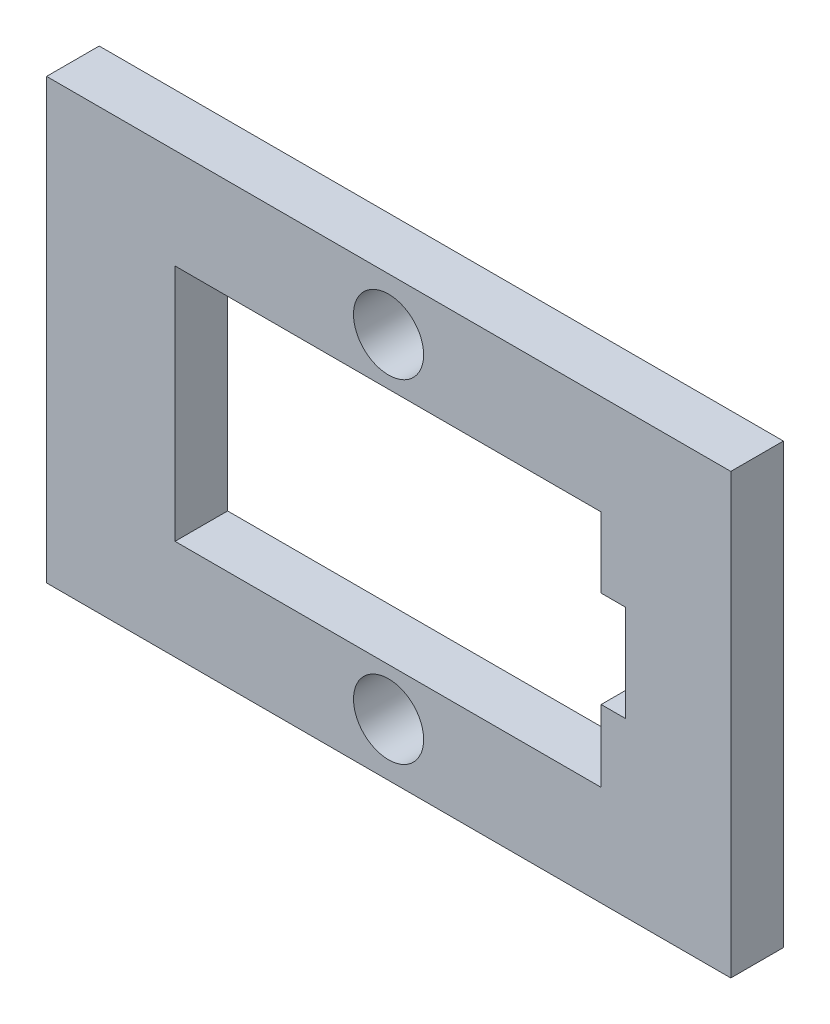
ISO-10303-21;
HEADER;
FILE_DESCRIPTION(('STEP AP214'),'2;1');
FILE_NAME('part.step','',(''),(''),'','','');
FILE_SCHEMA(('AUTOMOTIVE_DESIGN { 1 0 10303 214 1 1 1 1 }'));
ENDSEC;
DATA;
#1=APPLICATION_CONTEXT('core data for automotive mechanical design processes');
#2=APPLICATION_PROTOCOL_DEFINITION('international standard','automotive_design',2000,#1);
#3=PRODUCT_CONTEXT('',#1,'mechanical');
#4=PRODUCT('Part','Part','',(#3));
#5=PRODUCT_RELATED_PRODUCT_CATEGORY('part','',(#4));
#6=PRODUCT_DEFINITION_FORMATION('','',#4);
#7=PRODUCT_DEFINITION_CONTEXT('part definition',#1,'design');
#8=PRODUCT_DEFINITION('design','',#6,#7);
#9=PRODUCT_DEFINITION_SHAPE('','',#8);
#10=(LENGTH_UNIT() NAMED_UNIT(*) SI_UNIT(.MILLI.,.METRE.));
#11=(NAMED_UNIT(*) PLANE_ANGLE_UNIT() SI_UNIT($,.RADIAN.));
#12=(NAMED_UNIT(*) SI_UNIT($,.STERADIAN.) SOLID_ANGLE_UNIT());
#13=UNCERTAINTY_MEASURE_WITH_UNIT(LENGTH_MEASURE(1.E-05),#10,'distance_accuracy_value','');
#14=(GEOMETRIC_REPRESENTATION_CONTEXT(3) GLOBAL_UNCERTAINTY_ASSIGNED_CONTEXT((#13)) GLOBAL_UNIT_ASSIGNED_CONTEXT((#10,
#11,#12)) REPRESENTATION_CONTEXT('',''));
#15=CARTESIAN_POINT('',(0.,0.,0.));
#16=DIRECTION('',(0.,0.,1.));
#17=DIRECTION('',(1.,0.,0.));
#18=AXIS2_PLACEMENT_3D('',#15,#16,#17);
#19=CARTESIAN_POINT('',(4.52665068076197,5.9,0.));
#20=DIRECTION('',(0.,0.,1.));
#21=DIRECTION('',(1.,0.,0.));
#22=AXIS2_PLACEMENT_3D('',#19,#20,#21);
#23=PLANE('',#22);
#24=CARTESIAN_POINT('',(11.526650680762,15.4,0.));
#25=DIRECTION('',(0.,0.,1.));
#26=DIRECTION('',(1.,0.,0.));
#27=AXIS2_PLACEMENT_3D('',#24,#25,#26);
#28=CIRCLE('',#27,2.);
#29=CARTESIAN_POINT('',(13.526650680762,15.4,0.));
#30=VERTEX_POINT('',#29);
#31=EDGE_CURVE('E250',#30,#30,#28,.T.);
#32=ORIENTED_EDGE('',*,*,#31,.T.);
#33=EDGE_LOOP('',(#32));
#34=FACE_BOUND('',#33,.T.);
#35=DIRECTION('',(0.,-1.,0.));
#36=VECTOR('',#35,1.);
#37=CARTESIAN_POINT('',(-7.97334931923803,18.4,0.));
#38=LINE('',#37,#36);
#39=CARTESIAN_POINT('',(-7.97334931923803,18.4,0.));
#40=VERTEX_POINT('',#39);
#41=CARTESIAN_POINT('',(-7.97334931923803,-6.61865156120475,0.));
#42=VERTEX_POINT('',#41);
#43=EDGE_CURVE('E187',#40,#42,#38,.T.);
#44=ORIENTED_EDGE('',*,*,#43,.F.);
#45=DIRECTION('',(1.,0.,0.));
#46=VECTOR('',#45,1.);
#47=CARTESIAN_POINT('',(4.52665068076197,18.4,0.));
#48=LINE('',#47,#46);
#49=CARTESIAN_POINT('',(31.0425160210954,18.4,0.));
#50=VERTEX_POINT('',#49);
#51=EDGE_CURVE('E34',#40,#50,#48,.T.);
#52=ORIENTED_EDGE('',*,*,#51,.T.);
#53=DIRECTION('',(0.,1.,0.));
#54=VECTOR('',#53,1.);
#55=CARTESIAN_POINT('',(31.0425160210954,18.4,0.));
#56=LINE('',#55,#54);
#57=CARTESIAN_POINT('',(31.0425160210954,-6.61865156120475,0.));
#58=VERTEX_POINT('',#57);
#59=EDGE_CURVE('E193',#58,#50,#56,.T.);
#60=ORIENTED_EDGE('',*,*,#59,.F.);
#61=DIRECTION('',(1.,0.,0.));
#62=VECTOR('',#61,1.);
#63=CARTESIAN_POINT('',(-7.97334931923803,-6.61865156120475,0.));
#64=LINE('',#63,#62);
#65=EDGE_CURVE('E189',#42,#58,#64,.T.);
#66=ORIENTED_EDGE('',*,*,#65,.F.);
#67=EDGE_LOOP('',(#44,#52,#60,#66));
#68=FACE_BOUND('',#67,.T.);
#69=DIRECTION('',(0.,-1.,0.));
#70=VECTOR('',#69,1.);
#71=CARTESIAN_POINT('',(-0.650000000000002,12.7,0.));
#72=LINE('',#71,#70);
#73=CARTESIAN_POINT('',(-0.650000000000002,12.7,0.));
#74=VERTEX_POINT('',#73);
#75=CARTESIAN_POINT('',(-0.65,-0.9,0.));
#76=VERTEX_POINT('',#75);
#77=EDGE_CURVE('E45',#74,#76,#72,.T.);
#78=ORIENTED_EDGE('',*,*,#77,.T.);
#79=DIRECTION('',(1.,0.,0.));
#80=VECTOR('',#79,1.);
#81=CARTESIAN_POINT('',(-0.65,-0.9,0.));
#82=LINE('',#81,#80);
#83=CARTESIAN_POINT('',(23.65,-0.9,0.));
#84=VERTEX_POINT('',#83);
#85=EDGE_CURVE('E133',#76,#84,#82,.T.);
#86=ORIENTED_EDGE('',*,*,#85,.T.);
#87=DIRECTION('',(0.,1.,0.));
#88=VECTOR('',#87,1.);
#89=CARTESIAN_POINT('',(23.65,3.19246916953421,0.));
#90=LINE('',#89,#88);
#91=CARTESIAN_POINT('',(23.65,3.19246916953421,0.));
#92=VERTEX_POINT('',#91);
#93=EDGE_CURVE('E159',#84,#92,#90,.T.);
#94=ORIENTED_EDGE('',*,*,#93,.T.);
#95=DIRECTION('',(1.,0.,0.));
#96=VECTOR('',#95,1.);
#97=CARTESIAN_POINT('',(25.0510633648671,3.19246916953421,0.));
#98=LINE('',#97,#96);
#99=CARTESIAN_POINT('',(25.0510633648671,3.19246916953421,0.));
#100=VERTEX_POINT('',#99);
#101=EDGE_CURVE('E162',#92,#100,#98,.T.);
#102=ORIENTED_EDGE('',*,*,#101,.T.);
#103=DIRECTION('',(0.,1.,0.));
#104=VECTOR('',#103,1.);
#105=CARTESIAN_POINT('',(25.0510633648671,8.69069832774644,0.));
#106=LINE('',#105,#104);
#107=CARTESIAN_POINT('',(25.0510633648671,8.69069832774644,0.));
#108=VERTEX_POINT('',#107);
#109=EDGE_CURVE('E165',#100,#108,#106,.T.);
#110=ORIENTED_EDGE('',*,*,#109,.T.);
#111=DIRECTION('',(-1.,0.,0.));
#112=VECTOR('',#111,1.);
#113=CARTESIAN_POINT('',(25.0510633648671,8.69069832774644,0.));
#114=LINE('',#113,#112);
#115=CARTESIAN_POINT('',(23.65,8.69069832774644,0.));
#116=VERTEX_POINT('',#115);
#117=EDGE_CURVE('E168',#108,#116,#114,.T.);
#118=ORIENTED_EDGE('',*,*,#117,.T.);
#119=DIRECTION('',(0.,1.,0.));
#120=VECTOR('',#119,1.);
#121=CARTESIAN_POINT('',(23.65,8.69069832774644,0.));
#122=LINE('',#121,#120);
#123=CARTESIAN_POINT('',(23.65,12.7,0.));
#124=VERTEX_POINT('',#123);
#125=EDGE_CURVE('E171',#116,#124,#122,.T.);
#126=ORIENTED_EDGE('',*,*,#125,.T.);
#127=DIRECTION('',(-1.,0.,0.));
#128=VECTOR('',#127,1.);
#129=CARTESIAN_POINT('',(-0.650000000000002,12.7,0.));
#130=LINE('',#129,#128);
#131=EDGE_CURVE('E127',#124,#74,#130,.T.);
#132=ORIENTED_EDGE('',*,*,#131,.T.);
#133=EDGE_LOOP('',(#78,#86,#94,#102,#110,#118,#126,#132));
#134=FACE_BOUND('',#133,.T.);
#135=CARTESIAN_POINT('',(11.526650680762,-3.6,0.));
#136=DIRECTION('',(0.,0.,1.));
#137=DIRECTION('',(1.,0.,0.));
#138=AXIS2_PLACEMENT_3D('',#135,#136,#137);
#139=CIRCLE('',#138,2.);
#140=CARTESIAN_POINT('',(13.526650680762,-3.6,0.));
#141=VERTEX_POINT('',#140);
#142=EDGE_CURVE('E256',#141,#141,#139,.T.);
#143=ORIENTED_EDGE('',*,*,#142,.T.);
#144=EDGE_LOOP('',(#143));
#145=FACE_BOUND('',#144,.T.);
#146=ADVANCED_FACE('F31',(#34,#68,#134,#145),#23,.F.);
#147=CARTESIAN_POINT('',(4.52665068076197,5.9,3.));
#148=DIRECTION('',(0.,0.,1.));
#149=DIRECTION('',(1.,0.,0.));
#150=AXIS2_PLACEMENT_3D('',#147,#148,#149);
#151=PLANE('',#150);
#152=CARTESIAN_POINT('',(11.526650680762,15.4,3.));
#153=DIRECTION('',(0.,0.,1.));
#154=DIRECTION('',(1.,0.,0.));
#155=AXIS2_PLACEMENT_3D('',#152,#153,#154);
#156=CIRCLE('',#155,2.);
#157=CARTESIAN_POINT('',(13.526650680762,15.4,3.));
#158=VERTEX_POINT('',#157);
#159=EDGE_CURVE('E157',#158,#158,#156,.T.);
#160=ORIENTED_EDGE('',*,*,#159,.F.);
#161=EDGE_LOOP('',(#160));
#162=FACE_BOUND('',#161,.T.);
#163=DIRECTION('',(1.,0.,0.));
#164=VECTOR('',#163,1.);
#165=CARTESIAN_POINT('',(4.52665068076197,18.4,3.));
#166=LINE('',#165,#164);
#167=CARTESIAN_POINT('',(31.0425160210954,18.4,3.));
#168=VERTEX_POINT('',#167);
#169=CARTESIAN_POINT('',(-7.97334931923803,18.4,3.));
#170=VERTEX_POINT('',#169);
#171=EDGE_CURVE('E11',#168,#170,#166,.F.);
#172=ORIENTED_EDGE('',*,*,#171,.T.);
#173=DIRECTION('',(0.,-1.,0.));
#174=VECTOR('',#173,1.);
#175=CARTESIAN_POINT('',(-7.97334931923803,18.4,3.));
#176=LINE('',#175,#174);
#177=CARTESIAN_POINT('',(-7.97334931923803,-6.61865156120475,3.));
#178=VERTEX_POINT('',#177);
#179=EDGE_CURVE('E134',#170,#178,#176,.T.);
#180=ORIENTED_EDGE('',*,*,#179,.T.);
#181=DIRECTION('',(1.,0.,0.));
#182=VECTOR('',#181,1.);
#183=CARTESIAN_POINT('',(-7.97334931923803,-6.61865156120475,3.));
#184=LINE('',#183,#182);
#185=CARTESIAN_POINT('',(31.0425160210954,-6.61865156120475,3.));
#186=VERTEX_POINT('',#185);
#187=EDGE_CURVE('E198',#178,#186,#184,.T.);
#188=ORIENTED_EDGE('',*,*,#187,.T.);
#189=DIRECTION('',(0.,1.,0.));
#190=VECTOR('',#189,1.);
#191=CARTESIAN_POINT('',(31.0425160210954,18.4,3.));
#192=LINE('',#191,#190);
#193=EDGE_CURVE('E190',#186,#168,#192,.T.);
#194=ORIENTED_EDGE('',*,*,#193,.T.);
#195=EDGE_LOOP('',(#172,#180,#188,#194));
#196=FACE_BOUND('',#195,.T.);
#197=DIRECTION('',(1.,0.,0.));
#198=VECTOR('',#197,1.);
#199=CARTESIAN_POINT('',(-0.65,-0.9,3.));
#200=LINE('',#199,#198);
#201=CARTESIAN_POINT('',(-0.65,-0.9,3.));
#202=VERTEX_POINT('',#201);
#203=CARTESIAN_POINT('',(23.65,-0.9,3.));
#204=VERTEX_POINT('',#203);
#205=EDGE_CURVE('E126',#202,#204,#200,.T.);
#206=ORIENTED_EDGE('',*,*,#205,.F.);
#207=DIRECTION('',(0.,-1.,0.));
#208=VECTOR('',#207,1.);
#209=CARTESIAN_POINT('',(-0.650000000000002,12.7,3.));
#210=LINE('',#209,#208);
#211=CARTESIAN_POINT('',(-0.650000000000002,12.7,3.));
#212=VERTEX_POINT('',#211);
#213=EDGE_CURVE('E118',#212,#202,#210,.T.);
#214=ORIENTED_EDGE('',*,*,#213,.F.);
#215=DIRECTION('',(-1.,0.,0.));
#216=VECTOR('',#215,1.);
#217=CARTESIAN_POINT('',(-0.650000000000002,12.7,3.));
#218=LINE('',#217,#216);
#219=CARTESIAN_POINT('',(23.65,12.7,3.));
#220=VERTEX_POINT('',#219);
#221=EDGE_CURVE('E154',#220,#212,#218,.T.);
#222=ORIENTED_EDGE('',*,*,#221,.F.);
#223=DIRECTION('',(0.,1.,0.));
#224=VECTOR('',#223,1.);
#225=CARTESIAN_POINT('',(23.65,8.69069832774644,3.));
#226=LINE('',#225,#224);
#227=CARTESIAN_POINT('',(23.65,8.69069832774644,3.));
#228=VERTEX_POINT('',#227);
#229=EDGE_CURVE('E152',#228,#220,#226,.T.);
#230=ORIENTED_EDGE('',*,*,#229,.F.);
#231=DIRECTION('',(-1.,0.,0.));
#232=VECTOR('',#231,1.);
#233=CARTESIAN_POINT('',(25.0510633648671,8.69069832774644,3.));
#234=LINE('',#233,#232);
#235=CARTESIAN_POINT('',(25.0510633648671,8.69069832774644,3.));
#236=VERTEX_POINT('',#235);
#237=EDGE_CURVE('E150',#236,#228,#234,.T.);
#238=ORIENTED_EDGE('',*,*,#237,.F.);
#239=DIRECTION('',(0.,1.,0.));
#240=VECTOR('',#239,1.);
#241=CARTESIAN_POINT('',(25.0510633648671,8.69069832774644,3.));
#242=LINE('',#241,#240);
#243=CARTESIAN_POINT('',(25.0510633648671,3.19246916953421,3.));
#244=VERTEX_POINT('',#243);
#245=EDGE_CURVE('E148',#244,#236,#242,.T.);
#246=ORIENTED_EDGE('',*,*,#245,.F.);
#247=DIRECTION('',(1.,0.,0.));
#248=VECTOR('',#247,1.);
#249=CARTESIAN_POINT('',(25.0510633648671,3.19246916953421,3.));
#250=LINE('',#249,#248);
#251=CARTESIAN_POINT('',(23.65,3.19246916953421,3.));
#252=VERTEX_POINT('',#251);
#253=EDGE_CURVE('E143',#252,#244,#250,.T.);
#254=ORIENTED_EDGE('',*,*,#253,.F.);
#255=DIRECTION('',(0.,1.,0.));
#256=VECTOR('',#255,1.);
#257=CARTESIAN_POINT('',(23.65,3.19246916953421,3.));
#258=LINE('',#257,#256);
#259=EDGE_CURVE('E141',#204,#252,#258,.T.);
#260=ORIENTED_EDGE('',*,*,#259,.F.);
#261=EDGE_LOOP('',(#206,#214,#222,#230,#238,#246,#254,#260));
#262=FACE_BOUND('',#261,.T.);
#263=CARTESIAN_POINT('',(11.526650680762,-3.6,3.));
#264=DIRECTION('',(0.,0.,1.));
#265=DIRECTION('',(1.,0.,0.));
#266=AXIS2_PLACEMENT_3D('',#263,#264,#265);
#267=CIRCLE('',#266,2.);
#268=CARTESIAN_POINT('',(13.526650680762,-3.6,3.));
#269=VERTEX_POINT('',#268);
#270=EDGE_CURVE('E252',#269,#269,#267,.T.);
#271=ORIENTED_EDGE('',*,*,#270,.F.);
#272=EDGE_LOOP('',(#271));
#273=FACE_BOUND('',#272,.T.);
#274=ADVANCED_FACE('F138',(#162,#196,#262,#273),#151,.T.);
#275=CARTESIAN_POINT('',(-7.97334931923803,18.4,0.));
#276=DIRECTION('',(-1.,0.,0.));
#277=DIRECTION('',(0.,0.,1.));
#278=AXIS2_PLACEMENT_3D('',#275,#276,#277);
#279=PLANE('',#278);
#280=DIRECTION('',(0.,0.,1.));
#281=VECTOR('',#280,1.);
#282=CARTESIAN_POINT('',(-7.97334931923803,-6.61865156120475,0.));
#283=LINE('',#282,#281);
#284=EDGE_CURVE('E196',#42,#178,#283,.T.);
#285=ORIENTED_EDGE('',*,*,#284,.T.);
#286=ORIENTED_EDGE('',*,*,#179,.F.);
#287=DIRECTION('',(0.,0.,1.));
#288=VECTOR('',#287,1.);
#289=CARTESIAN_POINT('',(-7.97334931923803,18.4,0.));
#290=LINE('',#289,#288);
#291=EDGE_CURVE('E203',#40,#170,#290,.T.);
#292=ORIENTED_EDGE('',*,*,#291,.F.);
#293=ORIENTED_EDGE('',*,*,#43,.T.);
#294=EDGE_LOOP('',(#285,#286,#292,#293));
#295=FACE_BOUND('',#294,.T.);
#296=ADVANCED_FACE('F216',(#295),#279,.T.);
#297=CARTESIAN_POINT('',(31.0425160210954,18.4,0.));
#298=DIRECTION('',(1.,0.,0.));
#299=DIRECTION('',(0.,0.,-1.));
#300=AXIS2_PLACEMENT_3D('',#297,#298,#299);
#301=PLANE('',#300);
#302=ORIENTED_EDGE('',*,*,#193,.F.);
#303=DIRECTION('',(0.,0.,1.));
#304=VECTOR('',#303,1.);
#305=CARTESIAN_POINT('',(31.0425160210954,-6.61865156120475,0.));
#306=LINE('',#305,#304);
#307=EDGE_CURVE('E209',#58,#186,#306,.T.);
#308=ORIENTED_EDGE('',*,*,#307,.F.);
#309=ORIENTED_EDGE('',*,*,#59,.T.);
#310=DIRECTION('',(0.,0.,1.));
#311=VECTOR('',#310,1.);
#312=CARTESIAN_POINT('',(31.0425160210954,18.4,0.));
#313=LINE('',#312,#311);
#314=EDGE_CURVE('E206',#50,#168,#313,.T.);
#315=ORIENTED_EDGE('',*,*,#314,.T.);
#316=EDGE_LOOP('',(#302,#308,#309,#315));
#317=FACE_BOUND('',#316,.T.);
#318=ADVANCED_FACE('F231',(#317),#301,.T.);
#319=CARTESIAN_POINT('',(-7.97334931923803,-6.61865156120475,0.));
#320=DIRECTION('',(0.,-1.,0.));
#321=DIRECTION('',(0.,0.,-1.));
#322=AXIS2_PLACEMENT_3D('',#319,#320,#321);
#323=PLANE('',#322);
#324=ORIENTED_EDGE('',*,*,#187,.F.);
#325=ORIENTED_EDGE('',*,*,#284,.F.);
#326=ORIENTED_EDGE('',*,*,#65,.T.);
#327=ORIENTED_EDGE('',*,*,#307,.T.);
#328=EDGE_LOOP('',(#324,#325,#326,#327));
#329=FACE_BOUND('',#328,.T.);
#330=ADVANCED_FACE('F220',(#329),#323,.T.);
#331=CARTESIAN_POINT('',(4.52665068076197,18.4,3.));
#332=DIRECTION('',(0.,-1.,0.));
#333=DIRECTION('',(0.,0.,-1.));
#334=AXIS2_PLACEMENT_3D('',#331,#332,#333);
#335=PLANE('',#334);
#336=ORIENTED_EDGE('',*,*,#51,.F.);
#337=ORIENTED_EDGE('',*,*,#291,.T.);
#338=ORIENTED_EDGE('',*,*,#171,.F.);
#339=ORIENTED_EDGE('',*,*,#314,.F.);
#340=EDGE_LOOP('',(#336,#337,#338,#339));
#341=FACE_BOUND('',#340,.T.);
#342=ADVANCED_FACE('F226',(#341),#335,.F.);
#343=CARTESIAN_POINT('',(-0.650000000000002,12.7,3.));
#344=DIRECTION('',(1.,0.,0.));
#345=DIRECTION('',(0.,1.,0.));
#346=AXIS2_PLACEMENT_3D('',#343,#344,#345);
#347=PLANE('',#346);
#348=ORIENTED_EDGE('',*,*,#77,.F.);
#349=DIRECTION('',(0.,0.,-1.));
#350=VECTOR('',#349,1.);
#351=CARTESIAN_POINT('',(-0.650000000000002,12.7,3.));
#352=LINE('',#351,#350);
#353=EDGE_CURVE('E122',#212,#74,#352,.T.);
#354=ORIENTED_EDGE('',*,*,#353,.F.);
#355=ORIENTED_EDGE('',*,*,#213,.T.);
#356=DIRECTION('',(0.,0.,-1.));
#357=VECTOR('',#356,1.);
#358=CARTESIAN_POINT('',(-0.65,-0.9,3.));
#359=LINE('',#358,#357);
#360=EDGE_CURVE('E121',#202,#76,#359,.T.);
#361=ORIENTED_EDGE('',*,*,#360,.T.);
#362=EDGE_LOOP('',(#348,#354,#355,#361));
#363=FACE_BOUND('',#362,.T.);
#364=ADVANCED_FACE('F120',(#363),#347,.T.);
#365=CARTESIAN_POINT('',(-0.65,-0.9,3.));
#366=DIRECTION('',(0.,1.,0.));
#367=DIRECTION('',(0.,0.,1.));
#368=AXIS2_PLACEMENT_3D('',#365,#366,#367);
#369=PLANE('',#368);
#370=ORIENTED_EDGE('',*,*,#85,.F.);
#371=ORIENTED_EDGE('',*,*,#360,.F.);
#372=ORIENTED_EDGE('',*,*,#205,.T.);
#373=DIRECTION('',(0.,0.,-1.));
#374=VECTOR('',#373,1.);
#375=CARTESIAN_POINT('',(23.65,-0.9,3.));
#376=LINE('',#375,#374);
#377=EDGE_CURVE('E135',#204,#84,#376,.T.);
#378=ORIENTED_EDGE('',*,*,#377,.T.);
#379=EDGE_LOOP('',(#370,#371,#372,#378));
#380=FACE_BOUND('',#379,.T.);
#381=ADVANCED_FACE('F130',(#380),#369,.T.);
#382=CARTESIAN_POINT('',(23.65,3.19246916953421,3.));
#383=DIRECTION('',(-1.,0.,0.));
#384=DIRECTION('',(0.,0.,1.));
#385=AXIS2_PLACEMENT_3D('',#382,#383,#384);
#386=PLANE('',#385);
#387=ORIENTED_EDGE('',*,*,#93,.F.);
#388=ORIENTED_EDGE('',*,*,#377,.F.);
#389=ORIENTED_EDGE('',*,*,#259,.T.);
#390=DIRECTION('',(0.,0.,-1.));
#391=VECTOR('',#390,1.);
#392=CARTESIAN_POINT('',(23.65,3.19246916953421,3.));
#393=LINE('',#392,#391);
#394=EDGE_CURVE('E184',#252,#92,#393,.T.);
#395=ORIENTED_EDGE('',*,*,#394,.T.);
#396=EDGE_LOOP('',(#387,#388,#389,#395));
#397=FACE_BOUND('',#396,.T.);
#398=ADVANCED_FACE('F292',(#397),#386,.T.);
#399=CARTESIAN_POINT('',(25.0510633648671,3.19246916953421,3.));
#400=DIRECTION('',(0.,1.,0.));
#401=DIRECTION('',(0.,0.,1.));
#402=AXIS2_PLACEMENT_3D('',#399,#400,#401);
#403=PLANE('',#402);
#404=ORIENTED_EDGE('',*,*,#101,.F.);
#405=ORIENTED_EDGE('',*,*,#394,.F.);
#406=ORIENTED_EDGE('',*,*,#253,.T.);
#407=DIRECTION('',(0.,0.,-1.));
#408=VECTOR('',#407,1.);
#409=CARTESIAN_POINT('',(25.0510633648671,3.19246916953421,3.));
#410=LINE('',#409,#408);
#411=EDGE_CURVE('E182',#244,#100,#410,.T.);
#412=ORIENTED_EDGE('',*,*,#411,.T.);
#413=EDGE_LOOP('',(#404,#405,#406,#412));
#414=FACE_BOUND('',#413,.T.);
#415=ADVANCED_FACE('F288',(#414),#403,.T.);
#416=CARTESIAN_POINT('',(25.0510633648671,8.69069832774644,3.));
#417=DIRECTION('',(-1.,0.,0.));
#418=DIRECTION('',(0.,0.,1.));
#419=AXIS2_PLACEMENT_3D('',#416,#417,#418);
#420=PLANE('',#419);
#421=ORIENTED_EDGE('',*,*,#109,.F.);
#422=ORIENTED_EDGE('',*,*,#411,.F.);
#423=ORIENTED_EDGE('',*,*,#245,.T.);
#424=DIRECTION('',(0.,0.,-1.));
#425=VECTOR('',#424,1.);
#426=CARTESIAN_POINT('',(25.0510633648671,8.69069832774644,3.));
#427=LINE('',#426,#425);
#428=EDGE_CURVE('E180',#236,#108,#427,.T.);
#429=ORIENTED_EDGE('',*,*,#428,.T.);
#430=EDGE_LOOP('',(#421,#422,#423,#429));
#431=FACE_BOUND('',#430,.T.);
#432=ADVANCED_FACE('F284',(#431),#420,.T.);
#433=CARTESIAN_POINT('',(25.0510633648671,8.69069832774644,3.));
#434=DIRECTION('',(0.,-1.,0.));
#435=DIRECTION('',(0.,0.,-1.));
#436=AXIS2_PLACEMENT_3D('',#433,#434,#435);
#437=PLANE('',#436);
#438=ORIENTED_EDGE('',*,*,#117,.F.);
#439=ORIENTED_EDGE('',*,*,#428,.F.);
#440=ORIENTED_EDGE('',*,*,#237,.T.);
#441=DIRECTION('',(0.,0.,-1.));
#442=VECTOR('',#441,1.);
#443=CARTESIAN_POINT('',(23.65,8.69069832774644,3.));
#444=LINE('',#443,#442);
#445=EDGE_CURVE('E178',#228,#116,#444,.T.);
#446=ORIENTED_EDGE('',*,*,#445,.T.);
#447=EDGE_LOOP('',(#438,#439,#440,#446));
#448=FACE_BOUND('',#447,.T.);
#449=ADVANCED_FACE('F280',(#448),#437,.T.);
#450=CARTESIAN_POINT('',(23.65,8.69069832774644,3.));
#451=DIRECTION('',(-1.,0.,0.));
#452=DIRECTION('',(0.,0.,1.));
#453=AXIS2_PLACEMENT_3D('',#450,#451,#452);
#454=PLANE('',#453);
#455=ORIENTED_EDGE('',*,*,#125,.F.);
#456=ORIENTED_EDGE('',*,*,#445,.F.);
#457=ORIENTED_EDGE('',*,*,#229,.T.);
#458=DIRECTION('',(0.,0.,-1.));
#459=VECTOR('',#458,1.);
#460=CARTESIAN_POINT('',(23.65,12.7,3.));
#461=LINE('',#460,#459);
#462=EDGE_CURVE('E53',#220,#124,#461,.T.);
#463=ORIENTED_EDGE('',*,*,#462,.T.);
#464=EDGE_LOOP('',(#455,#456,#457,#463));
#465=FACE_BOUND('',#464,.T.);
#466=ADVANCED_FACE('F277',(#465),#454,.T.);
#467=CARTESIAN_POINT('',(-0.650000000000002,12.7,3.));
#468=DIRECTION('',(0.,-1.,0.));
#469=DIRECTION('',(0.,0.,-1.));
#470=AXIS2_PLACEMENT_3D('',#467,#468,#469);
#471=PLANE('',#470);
#472=ORIENTED_EDGE('',*,*,#131,.F.);
#473=ORIENTED_EDGE('',*,*,#462,.F.);
#474=ORIENTED_EDGE('',*,*,#221,.T.);
#475=ORIENTED_EDGE('',*,*,#353,.T.);
#476=EDGE_LOOP('',(#472,#473,#474,#475));
#477=FACE_BOUND('',#476,.T.);
#478=ADVANCED_FACE('F271',(#477),#471,.T.);
#479=CARTESIAN_POINT('',(11.526650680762,15.4,3.));
#480=DIRECTION('',(0.,0.,-1.));
#481=DIRECTION('',(-1.,0.,0.));
#482=AXIS2_PLACEMENT_3D('',#479,#480,#481);
#483=CYLINDRICAL_SURFACE('',#482,2.);
#484=ORIENTED_EDGE('',*,*,#159,.T.);
#485=EDGE_LOOP('',(#484));
#486=FACE_BOUND('',#485,.T.);
#487=ORIENTED_EDGE('',*,*,#31,.F.);
#488=EDGE_LOOP('',(#487));
#489=FACE_BOUND('',#488,.T.);
#490=ADVANCED_FACE('F265',(#486,#489),#483,.F.);
#491=CARTESIAN_POINT('',(11.526650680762,-3.6,3.));
#492=DIRECTION('',(0.,0.,-1.));
#493=DIRECTION('',(-1.,0.,0.));
#494=AXIS2_PLACEMENT_3D('',#491,#492,#493);
#495=CYLINDRICAL_SURFACE('',#494,2.);
#496=ORIENTED_EDGE('',*,*,#270,.T.);
#497=EDGE_LOOP('',(#496));
#498=FACE_BOUND('',#497,.T.);
#499=ORIENTED_EDGE('',*,*,#142,.F.);
#500=EDGE_LOOP('',(#499));
#501=FACE_BOUND('',#500,.T.);
#502=ADVANCED_FACE('F263',(#498,#501),#495,.F.);
#503=CLOSED_SHELL('',(#146,#274,#296,#318,#330,#342,#364,#381,#398,#415,#432,#449,#466,#478,
#490,#502));
#504=MANIFOLD_SOLID_BREP('B2',#503);
#505=ADVANCED_BREP_SHAPE_REPRESENTATION('',(#18,#504),#14);
#506=SHAPE_DEFINITION_REPRESENTATION(#9,#505);
ENDSEC;
END-ISO-10303-21;
